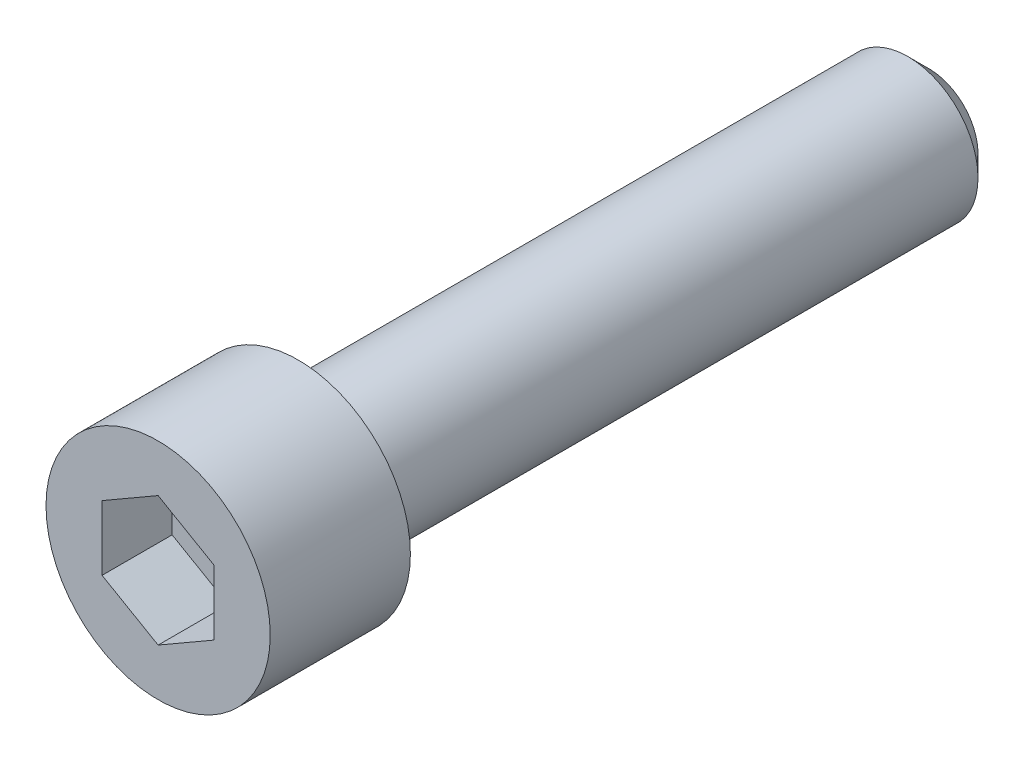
ISO-10303-21;
HEADER;
FILE_DESCRIPTION(('STEP AP214'),'2;1');
FILE_NAME('part.step','',(''),(''),'','','');
FILE_SCHEMA(('AUTOMOTIVE_DESIGN { 1 0 10303 214 1 1 1 1 }'));
ENDSEC;
DATA;
#1=APPLICATION_CONTEXT('core data for automotive mechanical design processes');
#2=APPLICATION_PROTOCOL_DEFINITION('international standard','automotive_design',2000,#1);
#3=PRODUCT_CONTEXT('',#1,'mechanical');
#4=PRODUCT('Part','Part','',(#3));
#5=PRODUCT_RELATED_PRODUCT_CATEGORY('part','',(#4));
#6=PRODUCT_DEFINITION_FORMATION('','',#4);
#7=PRODUCT_DEFINITION_CONTEXT('part definition',#1,'design');
#8=PRODUCT_DEFINITION('design','',#6,#7);
#9=PRODUCT_DEFINITION_SHAPE('','',#8);
#10=(LENGTH_UNIT() NAMED_UNIT(*) SI_UNIT(.MILLI.,.METRE.));
#11=(NAMED_UNIT(*) PLANE_ANGLE_UNIT() SI_UNIT($,.RADIAN.));
#12=(NAMED_UNIT(*) SI_UNIT($,.STERADIAN.) SOLID_ANGLE_UNIT());
#13=UNCERTAINTY_MEASURE_WITH_UNIT(LENGTH_MEASURE(1.E-05),#10,'distance_accuracy_value','');
#14=(GEOMETRIC_REPRESENTATION_CONTEXT(3) GLOBAL_UNCERTAINTY_ASSIGNED_CONTEXT((#13)) GLOBAL_UNIT_ASSIGNED_CONTEXT((#10,
#11,#12)) REPRESENTATION_CONTEXT('',''));
#15=CARTESIAN_POINT('',(0.,0.,0.));
#16=DIRECTION('',(0.,0.,1.));
#17=DIRECTION('',(1.,0.,0.));
#18=AXIS2_PLACEMENT_3D('',#15,#16,#17);
#19=CARTESIAN_POINT('',(0.,4.618802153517,5.));
#20=DIRECTION('',(-0.5,-0.86602540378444,0.));
#21=DIRECTION('',(0.86602540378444,-0.5,0.));
#22=AXIS2_PLACEMENT_3D('',#19,#20,#21);
#23=PLANE('',#22);
#24=DIRECTION('',(0.,0.,1.));
#25=VECTOR('',#24,1.);
#26=CARTESIAN_POINT('',(4.,2.30940107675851,5.));
#27=LINE('',#26,#25);
#28=CARTESIAN_POINT('',(4.,2.30940107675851,5.));
#29=VERTEX_POINT('',#28);
#30=CARTESIAN_POINT('',(4.,2.30940107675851,10.));
#31=VERTEX_POINT('',#30);
#32=EDGE_CURVE('E63',#29,#31,#27,.T.);
#33=ORIENTED_EDGE('',*,*,#32,.T.);
#34=DIRECTION('',(0.86602540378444,-0.5,0.));
#35=VECTOR('',#34,1.);
#36=CARTESIAN_POINT('',(0.,4.618802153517,10.));
#37=LINE('',#36,#35);
#38=CARTESIAN_POINT('',(0.,4.618802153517,10.));
#39=VERTEX_POINT('',#38);
#40=EDGE_CURVE('E29',#39,#31,#37,.T.);
#41=ORIENTED_EDGE('',*,*,#40,.F.);
#42=DIRECTION('',(0.,0.,1.));
#43=VECTOR('',#42,1.);
#44=CARTESIAN_POINT('',(0.,4.618802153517,5.));
#45=LINE('',#44,#43);
#46=CARTESIAN_POINT('',(0.,4.618802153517,5.));
#47=VERTEX_POINT('',#46);
#48=EDGE_CURVE('E33',#47,#39,#45,.T.);
#49=ORIENTED_EDGE('',*,*,#48,.F.);
#50=DIRECTION('',(0.86602540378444,-0.5,0.));
#51=VECTOR('',#50,1.);
#52=CARTESIAN_POINT('',(0.,4.618802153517,5.));
#53=LINE('',#52,#51);
#54=EDGE_CURVE('E65',#47,#29,#53,.T.);
#55=ORIENTED_EDGE('',*,*,#54,.T.);
#56=EDGE_LOOP('',(#33,#41,#49,#55));
#57=FACE_BOUND('',#56,.T.);
#58=ADVANCED_FACE('F14',(#57),#23,.T.);
#59=CARTESIAN_POINT('',(4.,-2.30940107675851,5.));
#60=DIRECTION('',(1.,0.,0.));
#61=DIRECTION('',(0.,1.,0.));
#62=AXIS2_PLACEMENT_3D('',#59,#60,#61);
#63=PLANE('',#62);
#64=DIRECTION('',(0.,0.,1.));
#65=VECTOR('',#64,1.);
#66=CARTESIAN_POINT('',(4.,-2.30940107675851,5.));
#67=LINE('',#66,#65);
#68=CARTESIAN_POINT('',(4.,-2.30940107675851,5.));
#69=VERTEX_POINT('',#68);
#70=CARTESIAN_POINT('',(4.,-2.30940107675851,10.));
#71=VERTEX_POINT('',#70);
#72=EDGE_CURVE('E70',#69,#71,#67,.T.);
#73=ORIENTED_EDGE('',*,*,#72,.T.);
#74=DIRECTION('',(0.,1.,0.));
#75=VECTOR('',#74,1.);
#76=CARTESIAN_POINT('',(4.,-2.30940107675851,10.));
#77=LINE('',#76,#75);
#78=EDGE_CURVE('E73',#71,#31,#77,.T.);
#79=ORIENTED_EDGE('',*,*,#78,.T.);
#80=ORIENTED_EDGE('',*,*,#32,.F.);
#81=DIRECTION('',(0.,1.,0.));
#82=VECTOR('',#81,1.);
#83=CARTESIAN_POINT('',(4.,-2.30940107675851,5.));
#84=LINE('',#83,#82);
#85=EDGE_CURVE('E100',#69,#29,#84,.T.);
#86=ORIENTED_EDGE('',*,*,#85,.F.);
#87=EDGE_LOOP('',(#73,#79,#80,#86));
#88=FACE_BOUND('',#87,.T.);
#89=ADVANCED_FACE('F74',(#88),#63,.F.);
#90=CARTESIAN_POINT('',(0.,-4.618802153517,5.));
#91=DIRECTION('',(0.5,-0.86602540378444,0.));
#92=DIRECTION('',(0.86602540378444,0.5,0.));
#93=AXIS2_PLACEMENT_3D('',#90,#91,#92);
#94=PLANE('',#93);
#95=DIRECTION('',(0.,0.,1.));
#96=VECTOR('',#95,1.);
#97=CARTESIAN_POINT('',(0.,-4.618802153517,5.));
#98=LINE('',#97,#96);
#99=CARTESIAN_POINT('',(0.,-4.618802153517,5.));
#100=VERTEX_POINT('',#99);
#101=CARTESIAN_POINT('',(0.,-4.618802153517,10.));
#102=VERTEX_POINT('',#101);
#103=EDGE_CURVE('E108',#100,#102,#98,.T.);
#104=ORIENTED_EDGE('',*,*,#103,.T.);
#105=DIRECTION('',(0.86602540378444,0.5,0.));
#106=VECTOR('',#105,1.);
#107=CARTESIAN_POINT('',(0.,-4.618802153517,10.));
#108=LINE('',#107,#106);
#109=EDGE_CURVE('E78',#102,#71,#108,.T.);
#110=ORIENTED_EDGE('',*,*,#109,.T.);
#111=ORIENTED_EDGE('',*,*,#72,.F.);
#112=DIRECTION('',(0.86602540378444,0.5,0.));
#113=VECTOR('',#112,1.);
#114=CARTESIAN_POINT('',(0.,-4.618802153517,5.));
#115=LINE('',#114,#113);
#116=EDGE_CURVE('E97',#100,#69,#115,.T.);
#117=ORIENTED_EDGE('',*,*,#116,.F.);
#118=EDGE_LOOP('',(#104,#110,#111,#117));
#119=FACE_BOUND('',#118,.T.);
#120=ADVANCED_FACE('F141',(#119),#94,.F.);
#121=CARTESIAN_POINT('',(0.,-4.618802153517,5.));
#122=DIRECTION('',(0.5,0.86602540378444,0.));
#123=DIRECTION('',(-0.86602540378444,0.5,0.));
#124=AXIS2_PLACEMENT_3D('',#121,#122,#123);
#125=PLANE('',#124);
#126=DIRECTION('',(0.,0.,1.));
#127=VECTOR('',#126,1.);
#128=CARTESIAN_POINT('',(-4.,-2.30940107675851,5.));
#129=LINE('',#128,#127);
#130=CARTESIAN_POINT('',(-4.,-2.30940107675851,5.));
#131=VERTEX_POINT('',#130);
#132=CARTESIAN_POINT('',(-4.,-2.30940107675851,10.));
#133=VERTEX_POINT('',#132);
#134=EDGE_CURVE('E106',#131,#133,#129,.T.);
#135=ORIENTED_EDGE('',*,*,#134,.T.);
#136=DIRECTION('',(-0.86602540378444,0.5,0.));
#137=VECTOR('',#136,1.);
#138=CARTESIAN_POINT('',(0.,-4.618802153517,10.));
#139=LINE('',#138,#137);
#140=EDGE_CURVE('E189',#102,#133,#139,.T.);
#141=ORIENTED_EDGE('',*,*,#140,.F.);
#142=ORIENTED_EDGE('',*,*,#103,.F.);
#143=DIRECTION('',(-0.86602540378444,0.5,0.));
#144=VECTOR('',#143,1.);
#145=CARTESIAN_POINT('',(0.,-4.618802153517,5.));
#146=LINE('',#145,#144);
#147=EDGE_CURVE('E94',#100,#131,#146,.T.);
#148=ORIENTED_EDGE('',*,*,#147,.T.);
#149=EDGE_LOOP('',(#135,#141,#142,#148));
#150=FACE_BOUND('',#149,.T.);
#151=ADVANCED_FACE('F153',(#150),#125,.T.);
#152=CARTESIAN_POINT('',(-4.,2.30940107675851,5.));
#153=DIRECTION('',(-1.,0.,0.));
#154=DIRECTION('',(0.,0.,1.));
#155=AXIS2_PLACEMENT_3D('',#152,#153,#154);
#156=PLANE('',#155);
#157=DIRECTION('',(0.,0.,1.));
#158=VECTOR('',#157,1.);
#159=CARTESIAN_POINT('',(-4.,2.30940107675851,5.));
#160=LINE('',#159,#158);
#161=CARTESIAN_POINT('',(-4.,2.30940107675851,5.));
#162=VERTEX_POINT('',#161);
#163=CARTESIAN_POINT('',(-4.,2.30940107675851,10.));
#164=VERTEX_POINT('',#163);
#165=EDGE_CURVE('E104',#162,#164,#160,.T.);
#166=ORIENTED_EDGE('',*,*,#165,.T.);
#167=DIRECTION('',(0.,-1.,0.));
#168=VECTOR('',#167,1.);
#169=CARTESIAN_POINT('',(-4.,2.30940107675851,10.));
#170=LINE('',#169,#168);
#171=EDGE_CURVE('E190',#164,#133,#170,.T.);
#172=ORIENTED_EDGE('',*,*,#171,.T.);
#173=ORIENTED_EDGE('',*,*,#134,.F.);
#174=DIRECTION('',(0.,-1.,0.));
#175=VECTOR('',#174,1.);
#176=CARTESIAN_POINT('',(-4.,2.30940107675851,5.));
#177=LINE('',#176,#175);
#178=EDGE_CURVE('E91',#162,#131,#177,.T.);
#179=ORIENTED_EDGE('',*,*,#178,.F.);
#180=EDGE_LOOP('',(#166,#172,#173,#179));
#181=FACE_BOUND('',#180,.T.);
#182=ADVANCED_FACE('F149',(#181),#156,.F.);
#183=CARTESIAN_POINT('',(0.,4.618802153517,5.));
#184=DIRECTION('',(-0.5,0.86602540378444,0.));
#185=DIRECTION('',(-0.86602540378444,-0.5,0.));
#186=AXIS2_PLACEMENT_3D('',#183,#184,#185);
#187=PLANE('',#186);
#188=DIRECTION('',(-0.86602540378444,-0.5,0.));
#189=VECTOR('',#188,1.);
#190=CARTESIAN_POINT('',(0.,4.618802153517,5.));
#191=LINE('',#190,#189);
#192=EDGE_CURVE('E88',#47,#162,#191,.T.);
#193=ORIENTED_EDGE('',*,*,#192,.F.);
#194=ORIENTED_EDGE('',*,*,#48,.T.);
#195=DIRECTION('',(-0.86602540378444,-0.5,0.));
#196=VECTOR('',#195,1.);
#197=CARTESIAN_POINT('',(0.,4.618802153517,10.));
#198=LINE('',#197,#196);
#199=EDGE_CURVE('E84',#39,#164,#198,.T.);
#200=ORIENTED_EDGE('',*,*,#199,.T.);
#201=ORIENTED_EDGE('',*,*,#165,.F.);
#202=EDGE_LOOP('',(#193,#194,#200,#201));
#203=FACE_BOUND('',#202,.T.);
#204=ADVANCED_FACE('F146',(#203),#187,.F.);
#205=CARTESIAN_POINT('',(-4.,6.92820323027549,5.));
#206=DIRECTION('',(0.,0.,-1.));
#207=DIRECTION('',(-1.,0.,0.));
#208=AXIS2_PLACEMENT_3D('',#205,#206,#207);
#209=PLANE('',#208);
#210=ORIENTED_EDGE('',*,*,#54,.F.);
#211=ORIENTED_EDGE('',*,*,#192,.T.);
#212=ORIENTED_EDGE('',*,*,#178,.T.);
#213=ORIENTED_EDGE('',*,*,#147,.F.);
#214=ORIENTED_EDGE('',*,*,#116,.T.);
#215=ORIENTED_EDGE('',*,*,#85,.T.);
#216=EDGE_LOOP('',(#210,#211,#212,#213,#214,#215));
#217=FACE_BOUND('',#216,.T.);
#218=ADVANCED_FACE('F145',(#217),#209,.F.);
#219=CARTESIAN_POINT('',(0.,0.,10.));
#220=DIRECTION('',(0.,0.,1.));
#221=DIRECTION('',(1.,0.,0.));
#222=AXIS2_PLACEMENT_3D('',#219,#220,#221);
#223=PLANE('',#222);
#224=CARTESIAN_POINT('',(0.,0.,10.));
#225=DIRECTION('',(0.,0.,1.));
#226=DIRECTION('',(1.,0.,0.));
#227=AXIS2_PLACEMENT_3D('',#224,#225,#226);
#228=CIRCLE('',#227,8.);
#229=CARTESIAN_POINT('',(8.,0.,10.));
#230=VERTEX_POINT('',#229);
#231=EDGE_CURVE('E116',#230,#230,#228,.T.);
#232=ORIENTED_EDGE('',*,*,#231,.T.);
#233=EDGE_LOOP('',(#232));
#234=FACE_BOUND('',#233,.T.);
#235=ORIENTED_EDGE('',*,*,#199,.F.);
#236=ORIENTED_EDGE('',*,*,#40,.T.);
#237=ORIENTED_EDGE('',*,*,#78,.F.);
#238=ORIENTED_EDGE('',*,*,#109,.F.);
#239=ORIENTED_EDGE('',*,*,#140,.T.);
#240=ORIENTED_EDGE('',*,*,#171,.F.);
#241=EDGE_LOOP('',(#235,#236,#237,#238,#239,#240));
#242=FACE_BOUND('',#241,.T.);
#243=ADVANCED_FACE('F81',(#234,#242),#223,.T.);
#244=CARTESIAN_POINT('',(0.,0.,-25.));
#245=DIRECTION('',(0.,0.,1.));
#246=DIRECTION('',(1.,0.,0.));
#247=AXIS2_PLACEMENT_3D('',#244,#245,#246);
#248=CYLINDRICAL_SURFACE('',#247,8.);
#249=CARTESIAN_POINT('',(0.,0.,0.));
#250=DIRECTION('',(0.,0.,1.));
#251=DIRECTION('',(1.,0.,0.));
#252=AXIS2_PLACEMENT_3D('',#249,#250,#251);
#253=CIRCLE('',#252,8.);
#254=CARTESIAN_POINT('',(8.,0.,0.));
#255=VERTEX_POINT('',#254);
#256=EDGE_CURVE('E113',#255,#255,#253,.T.);
#257=ORIENTED_EDGE('',*,*,#256,.T.);
#258=EDGE_LOOP('',(#257));
#259=FACE_BOUND('',#258,.T.);
#260=ORIENTED_EDGE('',*,*,#231,.F.);
#261=EDGE_LOOP('',(#260));
#262=FACE_BOUND('',#261,.T.);
#263=ADVANCED_FACE('F166',(#259,#262),#248,.T.);
#264=CARTESIAN_POINT('',(8.,0.,0.));
#265=DIRECTION('',(0.,0.,-1.));
#266=DIRECTION('',(-1.,0.,0.));
#267=AXIS2_PLACEMENT_3D('',#264,#265,#266);
#268=PLANE('',#267);
#269=CARTESIAN_POINT('',(0.,0.,0.));
#270=DIRECTION('',(0.,0.,1.));
#271=DIRECTION('',(1.,0.,0.));
#272=AXIS2_PLACEMENT_3D('',#269,#270,#271);
#273=CIRCLE('',#272,5.);
#274=CARTESIAN_POINT('',(5.,0.,0.));
#275=VERTEX_POINT('',#274);
#276=EDGE_CURVE('E69',#275,#275,#273,.T.);
#277=ORIENTED_EDGE('',*,*,#276,.T.);
#278=EDGE_LOOP('',(#277));
#279=FACE_BOUND('',#278,.T.);
#280=ORIENTED_EDGE('',*,*,#256,.F.);
#281=EDGE_LOOP('',(#280));
#282=FACE_BOUND('',#281,.T.);
#283=ADVANCED_FACE('F163',(#279,#282),#268,.T.);
#284=CARTESIAN_POINT('',(0.,0.,-25.));
#285=DIRECTION('',(0.,0.,1.));
#286=DIRECTION('',(1.,0.,0.));
#287=AXIS2_PLACEMENT_3D('',#284,#285,#286);
#288=CYLINDRICAL_SURFACE('',#287,5.);
#289=CARTESIAN_POINT('',(0.,0.,-43.5));
#290=DIRECTION('',(0.,0.,-1.));
#291=DIRECTION('',(-1.,0.,0.));
#292=AXIS2_PLACEMENT_3D('',#289,#290,#291);
#293=CIRCLE('',#292,5.);
#294=CARTESIAN_POINT('',(-5.,0.,-43.5));
#295=VERTEX_POINT('',#294);
#296=EDGE_CURVE('E22',#295,#295,#293,.F.);
#297=ORIENTED_EDGE('',*,*,#296,.T.);
#298=EDGE_LOOP('',(#297));
#299=FACE_BOUND('',#298,.T.);
#300=ORIENTED_EDGE('',*,*,#276,.F.);
#301=EDGE_LOOP('',(#300));
#302=FACE_BOUND('',#301,.T.);
#303=ADVANCED_FACE('F121',(#299,#302),#288,.T.);
#304=CARTESIAN_POINT('',(5.,0.,-45.));
#305=DIRECTION('',(0.,0.,-1.));
#306=DIRECTION('',(-1.,0.,0.));
#307=AXIS2_PLACEMENT_3D('',#304,#305,#306);
#308=PLANE('',#307);
#309=CARTESIAN_POINT('',(0.,0.,-45.));
#310=DIRECTION('',(0.,0.,-1.));
#311=DIRECTION('',(-1.,0.,0.));
#312=AXIS2_PLACEMENT_3D('',#309,#310,#311);
#313=CIRCLE('',#312,3.5);
#314=CARTESIAN_POINT('',(-3.5,0.,-45.));
#315=VERTEX_POINT('',#314);
#316=EDGE_CURVE('E9',#315,#315,#313,.T.);
#317=ORIENTED_EDGE('',*,*,#316,.T.);
#318=EDGE_LOOP('',(#317));
#319=FACE_BOUND('',#318,.T.);
#320=ADVANCED_FACE('F125',(#319),#308,.T.);
#321=CARTESIAN_POINT('',(0.,0.,-43.5));
#322=DIRECTION('',(0.,0.,1.));
#323=DIRECTION('',(1.,0.,0.));
#324=AXIS2_PLACEMENT_3D('',#321,#322,#323);
#325=CONICAL_SURFACE('',#324,5.,0.785398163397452);
#326=ORIENTED_EDGE('',*,*,#316,.F.);
#327=EDGE_LOOP('',(#326));
#328=FACE_BOUND('',#327,.T.);
#329=ORIENTED_EDGE('',*,*,#296,.F.);
#330=EDGE_LOOP('',(#329));
#331=FACE_BOUND('',#330,.T.);
#332=ADVANCED_FACE('F16',(#328,#331),#325,.T.);
#333=CLOSED_SHELL('',(#58,#89,#120,#151,#182,#204,#218,#243,#263,#283,#303,#320,#332));
#334=MANIFOLD_SOLID_BREP('B1',#333);
#335=ADVANCED_BREP_SHAPE_REPRESENTATION('',(#18,#334),#14);
#336=SHAPE_DEFINITION_REPRESENTATION(#9,#335);
ENDSEC;
END-ISO-10303-21;
